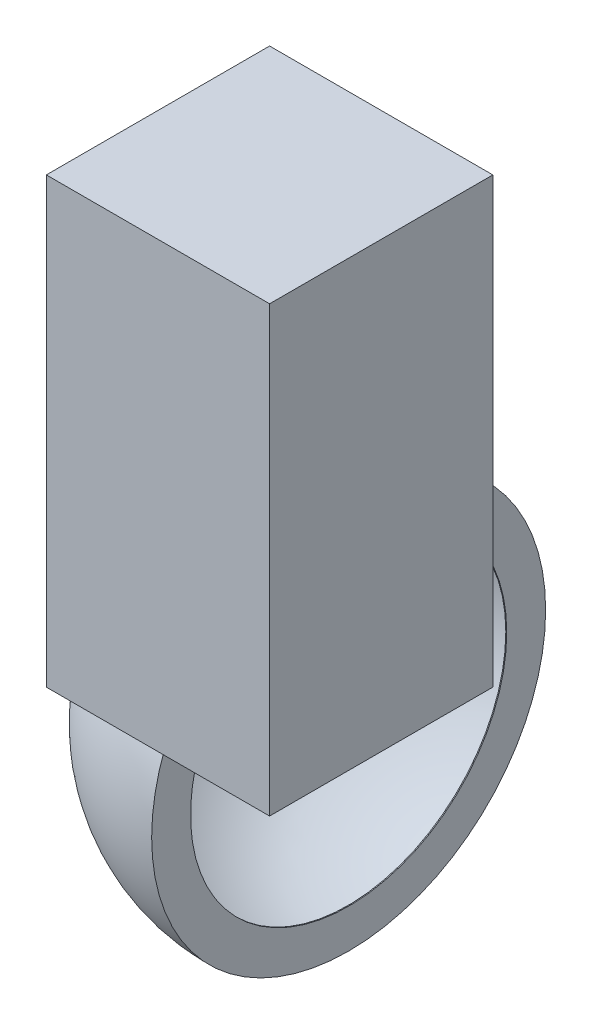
ISO-10303-21;
HEADER;
FILE_DESCRIPTION(('STEP AP214'),'2;1');
FILE_NAME('part.step','',(''),(''),'','','');
FILE_SCHEMA(('AUTOMOTIVE_DESIGN { 1 0 10303 214 1 1 1 1 }'));
ENDSEC;
DATA;
#1=APPLICATION_CONTEXT('core data for automotive mechanical design processes');
#2=APPLICATION_PROTOCOL_DEFINITION('international standard','automotive_design',2000,#1);
#3=PRODUCT_CONTEXT('',#1,'mechanical');
#4=PRODUCT('Part','Part','',(#3));
#5=PRODUCT_RELATED_PRODUCT_CATEGORY('part','',(#4));
#6=PRODUCT_DEFINITION_FORMATION('','',#4);
#7=PRODUCT_DEFINITION_CONTEXT('part definition',#1,'design');
#8=PRODUCT_DEFINITION('design','',#6,#7);
#9=PRODUCT_DEFINITION_SHAPE('','',#8);
#10=(LENGTH_UNIT() NAMED_UNIT(*) SI_UNIT(.MILLI.,.METRE.));
#11=(NAMED_UNIT(*) PLANE_ANGLE_UNIT() SI_UNIT($,.RADIAN.));
#12=(NAMED_UNIT(*) SI_UNIT($,.STERADIAN.) SOLID_ANGLE_UNIT());
#13=UNCERTAINTY_MEASURE_WITH_UNIT(LENGTH_MEASURE(1.E-05),#10,'distance_accuracy_value','');
#14=(GEOMETRIC_REPRESENTATION_CONTEXT(3) GLOBAL_UNCERTAINTY_ASSIGNED_CONTEXT((#13)) GLOBAL_UNIT_ASSIGNED_CONTEXT((#10,
#11,#12)) REPRESENTATION_CONTEXT('',''));
#15=CARTESIAN_POINT('',(0.,0.,0.));
#16=DIRECTION('',(0.,0.,1.));
#17=DIRECTION('',(1.,0.,0.));
#18=AXIS2_PLACEMENT_3D('',#15,#16,#17);
#19=CARTESIAN_POINT('',(-301.5,312.5,501.5));
#20=DIRECTION('',(0.,1.,0.));
#21=DIRECTION('',(0.,0.,1.));
#22=AXIS2_PLACEMENT_3D('',#19,#20,#21);
#23=PLANE('',#22);
#24=DIRECTION('',(0.,0.,1.));
#25=VECTOR('',#24,1.);
#26=CARTESIAN_POINT('',(-301.5,312.5,150.));
#27=LINE('',#26,#25);
#28=CARTESIAN_POINT('',(-301.5,312.5,148.5));
#29=VERTEX_POINT('',#28);
#30=CARTESIAN_POINT('',(-301.5,312.5,501.5));
#31=VERTEX_POINT('',#30);
#32=EDGE_CURVE('E194',#29,#31,#27,.T.);
#33=ORIENTED_EDGE('',*,*,#32,.F.);
#34=DIRECTION('',(-1.,0.,0.));
#35=VECTOR('',#34,1.);
#36=CARTESIAN_POINT('',(-300.,312.5,148.5));
#37=LINE('',#36,#35);
#38=CARTESIAN_POINT('',(51.5,312.5,148.5));
#39=VERTEX_POINT('',#38);
#40=EDGE_CURVE('E96',#39,#29,#37,.T.);
#41=ORIENTED_EDGE('',*,*,#40,.F.);
#42=DIRECTION('',(0.,0.,-1.));
#43=VECTOR('',#42,1.);
#44=CARTESIAN_POINT('',(51.5,312.5,150.));
#45=LINE('',#44,#43);
#46=CARTESIAN_POINT('',(51.5,312.5,501.5));
#47=VERTEX_POINT('',#46);
#48=EDGE_CURVE('E198',#47,#39,#45,.T.);
#49=ORIENTED_EDGE('',*,*,#48,.F.);
#50=DIRECTION('',(1.,0.,0.));
#51=VECTOR('',#50,1.);
#52=CARTESIAN_POINT('',(-300.,312.5,501.5));
#53=LINE('',#52,#51);
#54=EDGE_CURVE('E196',#31,#47,#53,.T.);
#55=ORIENTED_EDGE('',*,*,#54,.F.);
#56=EDGE_LOOP('',(#33,#41,#49,#55));
#57=FACE_BOUND('',#56,.T.);
#58=DIRECTION('',(0.,0.,1.));
#59=VECTOR('',#58,1.);
#60=CARTESIAN_POINT('',(-300.,312.5,500.));
#61=LINE('',#60,#59);
#62=CARTESIAN_POINT('',(-300.,312.5,150.));
#63=VERTEX_POINT('',#62);
#64=CARTESIAN_POINT('',(-300.,312.5,500.));
#65=VERTEX_POINT('',#64);
#66=EDGE_CURVE('E88',#63,#65,#61,.T.);
#67=ORIENTED_EDGE('',*,*,#66,.T.);
#68=DIRECTION('',(1.,0.,0.));
#69=VECTOR('',#68,1.);
#70=CARTESIAN_POINT('',(-300.,312.5,500.));
#71=LINE('',#70,#69);
#72=CARTESIAN_POINT('',(50.,312.5,500.));
#73=VERTEX_POINT('',#72);
#74=EDGE_CURVE('E179',#65,#73,#71,.T.);
#75=ORIENTED_EDGE('',*,*,#74,.T.);
#76=DIRECTION('',(0.,0.,-1.));
#77=VECTOR('',#76,1.);
#78=CARTESIAN_POINT('',(50.,312.5,150.));
#79=LINE('',#78,#77);
#80=CARTESIAN_POINT('',(50.,312.5,150.));
#81=VERTEX_POINT('',#80);
#82=EDGE_CURVE('E182',#73,#81,#79,.T.);
#83=ORIENTED_EDGE('',*,*,#82,.T.);
#84=DIRECTION('',(-1.,0.,0.));
#85=VECTOR('',#84,1.);
#86=CARTESIAN_POINT('',(-300.,312.5,150.));
#87=LINE('',#86,#85);
#88=EDGE_CURVE('E168',#81,#63,#87,.T.);
#89=ORIENTED_EDGE('',*,*,#88,.T.);
#90=EDGE_LOOP('',(#67,#75,#83,#89));
#91=FACE_BOUND('',#90,.T.);
#92=ADVANCED_FACE('F73',(#57,#91),#23,.F.);
#93=CARTESIAN_POINT('',(-301.5,1012.5,150.));
#94=DIRECTION('',(1.,0.,0.));
#95=DIRECTION('',(0.,0.,-1.));
#96=AXIS2_PLACEMENT_3D('',#93,#94,#95);
#97=PLANE('',#96);
#98=ORIENTED_EDGE('',*,*,#32,.T.);
#99=DIRECTION('',(0.,-1.,0.));
#100=VECTOR('',#99,1.);
#101=CARTESIAN_POINT('',(-301.5,1012.5,501.5));
#102=LINE('',#101,#100);
#103=CARTESIAN_POINT('',(-301.5,1014.,501.5));
#104=VERTEX_POINT('',#103);
#105=EDGE_CURVE('E13',#104,#31,#102,.T.);
#106=ORIENTED_EDGE('',*,*,#105,.F.);
#107=DIRECTION('',(0.,0.,1.));
#108=VECTOR('',#107,1.);
#109=CARTESIAN_POINT('',(-301.5,1014.,148.5));
#110=LINE('',#109,#108);
#111=CARTESIAN_POINT('',(-301.5,1014.,148.5));
#112=VERTEX_POINT('',#111);
#113=EDGE_CURVE('E150',#112,#104,#110,.T.);
#114=ORIENTED_EDGE('',*,*,#113,.F.);
#115=DIRECTION('',(0.,-1.,0.));
#116=VECTOR('',#115,1.);
#117=CARTESIAN_POINT('',(-301.5,1012.5,148.5));
#118=LINE('',#117,#116);
#119=EDGE_CURVE('E139',#112,#29,#118,.T.);
#120=ORIENTED_EDGE('',*,*,#119,.T.);
#121=EDGE_LOOP('',(#98,#106,#114,#120));
#122=FACE_BOUND('',#121,.T.);
#123=ADVANCED_FACE('F75',(#122),#97,.F.);
#124=CARTESIAN_POINT('',(-300.,1012.5,501.5));
#125=DIRECTION('',(0.,0.,-1.));
#126=DIRECTION('',(-1.,0.,0.));
#127=AXIS2_PLACEMENT_3D('',#124,#125,#126);
#128=PLANE('',#127);
#129=ORIENTED_EDGE('',*,*,#54,.T.);
#130=DIRECTION('',(0.,-1.,0.));
#131=VECTOR('',#130,1.);
#132=CARTESIAN_POINT('',(51.5,1012.5,501.5));
#133=LINE('',#132,#131);
#134=CARTESIAN_POINT('',(51.5,1014.,501.5));
#135=VERTEX_POINT('',#134);
#136=EDGE_CURVE('E81',#135,#47,#133,.T.);
#137=ORIENTED_EDGE('',*,*,#136,.F.);
#138=DIRECTION('',(1.,0.,0.));
#139=VECTOR('',#138,1.);
#140=CARTESIAN_POINT('',(-301.5,1014.,501.5));
#141=LINE('',#140,#139);
#142=EDGE_CURVE('E154',#104,#135,#141,.T.);
#143=ORIENTED_EDGE('',*,*,#142,.F.);
#144=ORIENTED_EDGE('',*,*,#105,.T.);
#145=EDGE_LOOP('',(#129,#137,#143,#144));
#146=FACE_BOUND('',#145,.T.);
#147=ADVANCED_FACE('F208',(#146),#128,.F.);
#148=CARTESIAN_POINT('',(51.5,1012.5,150.));
#149=DIRECTION('',(-1.,0.,0.));
#150=DIRECTION('',(0.,0.,1.));
#151=AXIS2_PLACEMENT_3D('',#148,#149,#150);
#152=PLANE('',#151);
#153=ORIENTED_EDGE('',*,*,#48,.T.);
#154=DIRECTION('',(0.,-1.,0.));
#155=VECTOR('',#154,1.);
#156=CARTESIAN_POINT('',(51.5,1012.5,148.5));
#157=LINE('',#156,#155);
#158=CARTESIAN_POINT('',(51.5,1014.,148.5));
#159=VERTEX_POINT('',#158);
#160=EDGE_CURVE('E147',#159,#39,#157,.T.);
#161=ORIENTED_EDGE('',*,*,#160,.F.);
#162=DIRECTION('',(0.,0.,-1.));
#163=VECTOR('',#162,1.);
#164=CARTESIAN_POINT('',(51.5,1014.,501.5));
#165=LINE('',#164,#163);
#166=EDGE_CURVE('E159',#135,#159,#165,.T.);
#167=ORIENTED_EDGE('',*,*,#166,.F.);
#168=ORIENTED_EDGE('',*,*,#136,.T.);
#169=EDGE_LOOP('',(#153,#161,#167,#168));
#170=FACE_BOUND('',#169,.T.);
#171=ADVANCED_FACE('F204',(#170),#152,.F.);
#172=CARTESIAN_POINT('',(-300.,1012.5,148.5));
#173=DIRECTION('',(0.,0.,1.));
#174=DIRECTION('',(1.,0.,0.));
#175=AXIS2_PLACEMENT_3D('',#172,#173,#174);
#176=PLANE('',#175);
#177=ORIENTED_EDGE('',*,*,#40,.T.);
#178=ORIENTED_EDGE('',*,*,#119,.F.);
#179=DIRECTION('',(-1.,0.,0.));
#180=VECTOR('',#179,1.);
#181=CARTESIAN_POINT('',(51.5,1014.,148.5));
#182=LINE('',#181,#180);
#183=EDGE_CURVE('E143',#159,#112,#182,.T.);
#184=ORIENTED_EDGE('',*,*,#183,.F.);
#185=ORIENTED_EDGE('',*,*,#160,.T.);
#186=EDGE_LOOP('',(#177,#178,#184,#185));
#187=FACE_BOUND('',#186,.T.);
#188=ADVANCED_FACE('F141',(#187),#176,.F.);
#189=CARTESIAN_POINT('',(-300.,1012.5,500.));
#190=DIRECTION('',(1.,0.,0.));
#191=DIRECTION('',(0.,0.,-1.));
#192=AXIS2_PLACEMENT_3D('',#189,#190,#191);
#193=PLANE('',#192);
#194=ORIENTED_EDGE('',*,*,#66,.F.);
#195=DIRECTION('',(0.,-1.,0.));
#196=VECTOR('',#195,1.);
#197=CARTESIAN_POINT('',(-300.,1012.5,150.));
#198=LINE('',#197,#196);
#199=CARTESIAN_POINT('',(-300.,1012.5,150.));
#200=VERTEX_POINT('',#199);
#201=EDGE_CURVE('E177',#200,#63,#198,.T.);
#202=ORIENTED_EDGE('',*,*,#201,.F.);
#203=DIRECTION('',(0.,0.,1.));
#204=VECTOR('',#203,1.);
#205=CARTESIAN_POINT('',(-300.,1012.5,500.));
#206=LINE('',#205,#204);
#207=CARTESIAN_POINT('',(-300.,1012.5,500.));
#208=VERTEX_POINT('',#207);
#209=EDGE_CURVE('E164',#200,#208,#206,.T.);
#210=ORIENTED_EDGE('',*,*,#209,.T.);
#211=DIRECTION('',(0.,-1.,0.));
#212=VECTOR('',#211,1.);
#213=CARTESIAN_POINT('',(-300.,1012.5,500.));
#214=LINE('',#213,#212);
#215=EDGE_CURVE('E192',#208,#65,#214,.T.);
#216=ORIENTED_EDGE('',*,*,#215,.T.);
#217=EDGE_LOOP('',(#194,#202,#210,#216));
#218=FACE_BOUND('',#217,.T.);
#219=ADVANCED_FACE('F221',(#218),#193,.T.);
#220=CARTESIAN_POINT('',(-300.,1012.5,500.));
#221=DIRECTION('',(0.,0.,-1.));
#222=DIRECTION('',(-1.,0.,0.));
#223=AXIS2_PLACEMENT_3D('',#220,#221,#222);
#224=PLANE('',#223);
#225=ORIENTED_EDGE('',*,*,#74,.F.);
#226=ORIENTED_EDGE('',*,*,#215,.F.);
#227=DIRECTION('',(1.,0.,0.));
#228=VECTOR('',#227,1.);
#229=CARTESIAN_POINT('',(-300.,1012.5,500.));
#230=LINE('',#229,#228);
#231=CARTESIAN_POINT('',(50.,1012.5,500.));
#232=VERTEX_POINT('',#231);
#233=EDGE_CURVE('E167',#208,#232,#230,.T.);
#234=ORIENTED_EDGE('',*,*,#233,.T.);
#235=DIRECTION('',(0.,-1.,0.));
#236=VECTOR('',#235,1.);
#237=CARTESIAN_POINT('',(50.,1012.5,500.));
#238=LINE('',#237,#236);
#239=EDGE_CURVE('E190',#232,#73,#238,.T.);
#240=ORIENTED_EDGE('',*,*,#239,.T.);
#241=EDGE_LOOP('',(#225,#226,#234,#240));
#242=FACE_BOUND('',#241,.T.);
#243=ADVANCED_FACE('F227',(#242),#224,.T.);
#244=CARTESIAN_POINT('',(50.,1012.5,150.));
#245=DIRECTION('',(-1.,0.,0.));
#246=DIRECTION('',(0.,0.,1.));
#247=AXIS2_PLACEMENT_3D('',#244,#245,#246);
#248=PLANE('',#247);
#249=ORIENTED_EDGE('',*,*,#82,.F.);
#250=ORIENTED_EDGE('',*,*,#239,.F.);
#251=DIRECTION('',(0.,0.,-1.));
#252=VECTOR('',#251,1.);
#253=CARTESIAN_POINT('',(50.,1012.5,150.));
#254=LINE('',#253,#252);
#255=CARTESIAN_POINT('',(50.,1012.5,150.));
#256=VERTEX_POINT('',#255);
#257=EDGE_CURVE('E171',#232,#256,#254,.T.);
#258=ORIENTED_EDGE('',*,*,#257,.T.);
#259=DIRECTION('',(0.,-1.,0.));
#260=VECTOR('',#259,1.);
#261=CARTESIAN_POINT('',(50.,1012.5,150.));
#262=LINE('',#261,#260);
#263=EDGE_CURVE('E188',#256,#81,#262,.T.);
#264=ORIENTED_EDGE('',*,*,#263,.T.);
#265=EDGE_LOOP('',(#249,#250,#258,#264));
#266=FACE_BOUND('',#265,.T.);
#267=ADVANCED_FACE('F231',(#266),#248,.T.);
#268=CARTESIAN_POINT('',(-300.,1012.5,150.));
#269=DIRECTION('',(0.,0.,1.));
#270=DIRECTION('',(1.,0.,0.));
#271=AXIS2_PLACEMENT_3D('',#268,#269,#270);
#272=PLANE('',#271);
#273=ORIENTED_EDGE('',*,*,#88,.F.);
#274=ORIENTED_EDGE('',*,*,#263,.F.);
#275=DIRECTION('',(-1.,0.,0.));
#276=VECTOR('',#275,1.);
#277=CARTESIAN_POINT('',(-300.,1012.5,150.));
#278=LINE('',#277,#276);
#279=EDGE_CURVE('E174',#256,#200,#278,.T.);
#280=ORIENTED_EDGE('',*,*,#279,.T.);
#281=ORIENTED_EDGE('',*,*,#201,.T.);
#282=EDGE_LOOP('',(#273,#274,#280,#281));
#283=FACE_BOUND('',#282,.T.);
#284=ADVANCED_FACE('F236',(#283),#272,.T.);
#285=CARTESIAN_POINT('',(-301.5,1012.5,148.5));
#286=DIRECTION('',(0.,1.,0.));
#287=DIRECTION('',(0.,0.,1.));
#288=AXIS2_PLACEMENT_3D('',#285,#286,#287);
#289=PLANE('',#288);
#290=ORIENTED_EDGE('',*,*,#209,.F.);
#291=ORIENTED_EDGE('',*,*,#279,.F.);
#292=ORIENTED_EDGE('',*,*,#257,.F.);
#293=ORIENTED_EDGE('',*,*,#233,.F.);
#294=EDGE_LOOP('',(#290,#291,#292,#293));
#295=FACE_BOUND('',#294,.T.);
#296=ADVANCED_FACE('F242',(#295),#289,.F.);
#297=CARTESIAN_POINT('',(-301.5,1014.,148.5));
#298=DIRECTION('',(0.,1.,0.));
#299=DIRECTION('',(0.,0.,1.));
#300=AXIS2_PLACEMENT_3D('',#297,#298,#299);
#301=PLANE('',#300);
#302=ORIENTED_EDGE('',*,*,#183,.T.);
#303=ORIENTED_EDGE('',*,*,#113,.T.);
#304=ORIENTED_EDGE('',*,*,#142,.T.);
#305=ORIENTED_EDGE('',*,*,#166,.T.);
#306=EDGE_LOOP('',(#302,#303,#304,#305));
#307=FACE_BOUND('',#306,.T.);
#308=ADVANCED_FACE('F157',(#307),#301,.T.);
#309=CLOSED_SHELL('',(#92,#123,#147,#171,#188,#219,#243,#267,#284,#296,#308));
#310=MANIFOLD_SOLID_BREP('B2',#309);
#311=CARTESIAN_POINT('',(-326.5,0.,0.));
#312=DIRECTION('',(1.,0.,0.));
#313=DIRECTION('',(0.,1.,0.));
#314=AXIS2_PLACEMENT_3D('',#311,#312,#313);
#315=SPHERICAL_SURFACE('',#314,311.5);
#316=CARTESIAN_POINT('',(-325.,0.,0.));
#317=DIRECTION('',(1.,0.,0.));
#318=DIRECTION('',(0.,0.,-1.));
#319=AXIS2_PLACEMENT_3D('',#316,#317,#318);
#320=CIRCLE('',#319,311.496388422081);
#321=CARTESIAN_POINT('',(-325.,0.,-311.496388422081));
#322=VERTEX_POINT('',#321);
#323=EDGE_CURVE('E354',#322,#322,#320,.T.);
#324=ORIENTED_EDGE('',*,*,#323,.F.);
#325=EDGE_LOOP('',(#324));
#326=FACE_BOUND('',#325,.T.);
#327=ADVANCED_FACE('F340',(#326),#315,.T.);
#328=CARTESIAN_POINT('',(-326.5,0.,0.));
#329=DIRECTION('',(1.,0.,0.));
#330=DIRECTION('',(0.,1.,0.));
#331=AXIS2_PLACEMENT_3D('',#328,#329,#330);
#332=SPHERICAL_SURFACE('',#331,310.);
#333=CARTESIAN_POINT('',(-326.5,0.,0.));
#334=DIRECTION('',(1.,0.,0.));
#335=DIRECTION('',(0.,0.,-1.));
#336=AXIS2_PLACEMENT_3D('',#333,#334,#335);
#337=CIRCLE('',#336,310.);
#338=CARTESIAN_POINT('',(-326.5,0.,-310.));
#339=VERTEX_POINT('',#338);
#340=EDGE_CURVE('E72',#339,#339,#337,.T.);
#341=ORIENTED_EDGE('',*,*,#340,.T.);
#342=EDGE_LOOP('',(#341));
#343=FACE_BOUND('',#342,.T.);
#344=ADVANCED_FACE('F364',(#343),#332,.F.);
#345=CARTESIAN_POINT('',(-326.5,250.,0.));
#346=DIRECTION('',(1.,0.,0.));
#347=DIRECTION('',(0.,0.,-1.));
#348=AXIS2_PLACEMENT_3D('',#345,#346,#347);
#349=PLANE('',#348);
#350=ORIENTED_EDGE('',*,*,#340,.F.);
#351=EDGE_LOOP('',(#350));
#352=FACE_BOUND('',#351,.T.);
#353=CARTESIAN_POINT('',(-326.5,0.,0.));
#354=DIRECTION('',(1.,0.,0.));
#355=DIRECTION('',(0.,0.,-1.));
#356=AXIS2_PLACEMENT_3D('',#353,#354,#355);
#357=CIRCLE('',#356,250.);
#358=CARTESIAN_POINT('',(-326.5,0.,-250.));
#359=VERTEX_POINT('',#358);
#360=EDGE_CURVE('E346',#359,#359,#357,.T.);
#361=ORIENTED_EDGE('',*,*,#360,.T.);
#362=EDGE_LOOP('',(#361));
#363=FACE_BOUND('',#362,.T.);
#364=ADVANCED_FACE('F368',(#352,#363),#349,.F.);
#365=CARTESIAN_POINT('',(0.,0.,0.));
#366=DIRECTION('',(1.,0.,0.));
#367=DIRECTION('',(0.,0.,-1.));
#368=AXIS2_PLACEMENT_3D('',#365,#366,#367);
#369=CYLINDRICAL_SURFACE('',#368,250.);
#370=ORIENTED_EDGE('',*,*,#360,.F.);
#371=EDGE_LOOP('',(#370));
#372=FACE_BOUND('',#371,.T.);
#373=CARTESIAN_POINT('',(-325.,0.,0.));
#374=DIRECTION('',(1.,0.,0.));
#375=DIRECTION('',(0.,0.,-1.));
#376=AXIS2_PLACEMENT_3D('',#373,#374,#375);
#377=CIRCLE('',#376,250.);
#378=CARTESIAN_POINT('',(-325.,0.,-250.));
#379=VERTEX_POINT('',#378);
#380=EDGE_CURVE('E350',#379,#379,#377,.T.);
#381=ORIENTED_EDGE('',*,*,#380,.T.);
#382=EDGE_LOOP('',(#381));
#383=FACE_BOUND('',#382,.T.);
#384=ADVANCED_FACE('F372',(#372,#383),#369,.F.);
#385=CARTESIAN_POINT('',(-325.,250.,0.));
#386=DIRECTION('',(1.,0.,0.));
#387=DIRECTION('',(0.,0.,-1.));
#388=AXIS2_PLACEMENT_3D('',#385,#386,#387);
#389=PLANE('',#388);
#390=ORIENTED_EDGE('',*,*,#323,.T.);
#391=EDGE_LOOP('',(#390));
#392=FACE_BOUND('',#391,.T.);
#393=ORIENTED_EDGE('',*,*,#380,.F.);
#394=EDGE_LOOP('',(#393));
#395=FACE_BOUND('',#394,.T.);
#396=ADVANCED_FACE('F360',(#392,#395),#389,.T.);
#397=CLOSED_SHELL('',(#327,#344,#364,#384,#396));
#398=MANIFOLD_SOLID_BREP('B7',#397);
#399=ADVANCED_BREP_SHAPE_REPRESENTATION('',(#18,#310,#398),#14);
#400=SHAPE_DEFINITION_REPRESENTATION(#9,#399);
ENDSEC;
END-ISO-10303-21;
